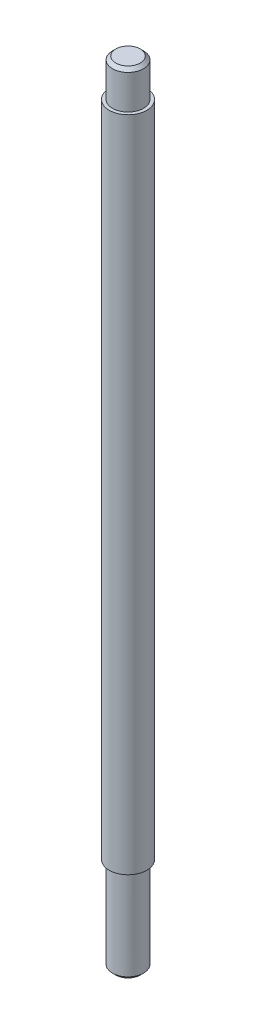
ISO-10303-21;
HEADER;
FILE_DESCRIPTION(('STEP AP214'),'2;1');
FILE_NAME('part.step','',(''),(''),'','','');
FILE_SCHEMA(('AUTOMOTIVE_DESIGN { 1 0 10303 214 1 1 1 1 }'));
ENDSEC;
DATA;
#1=APPLICATION_CONTEXT('core data for automotive mechanical design processes');
#2=APPLICATION_PROTOCOL_DEFINITION('international standard','automotive_design',2000,#1);
#3=PRODUCT_CONTEXT('',#1,'mechanical');
#4=PRODUCT('Part','Part','',(#3));
#5=PRODUCT_RELATED_PRODUCT_CATEGORY('part','',(#4));
#6=PRODUCT_DEFINITION_FORMATION('','',#4);
#7=PRODUCT_DEFINITION_CONTEXT('part definition',#1,'design');
#8=PRODUCT_DEFINITION('design','',#6,#7);
#9=PRODUCT_DEFINITION_SHAPE('','',#8);
#10=(LENGTH_UNIT() NAMED_UNIT(*) SI_UNIT(.MILLI.,.METRE.));
#11=(NAMED_UNIT(*) PLANE_ANGLE_UNIT() SI_UNIT($,.RADIAN.));
#12=(NAMED_UNIT(*) SI_UNIT($,.STERADIAN.) SOLID_ANGLE_UNIT());
#13=UNCERTAINTY_MEASURE_WITH_UNIT(LENGTH_MEASURE(1.E-05),#10,'distance_accuracy_value','');
#14=(GEOMETRIC_REPRESENTATION_CONTEXT(3) GLOBAL_UNCERTAINTY_ASSIGNED_CONTEXT((#13)) GLOBAL_UNIT_ASSIGNED_CONTEXT((#10,
#11,#12)) REPRESENTATION_CONTEXT('',''));
#15=CARTESIAN_POINT('',(0.,0.,0.));
#16=DIRECTION('',(0.,0.,1.));
#17=DIRECTION('',(1.,0.,0.));
#18=AXIS2_PLACEMENT_3D('',#15,#16,#17);
#19=CARTESIAN_POINT('',(0.,84.,0.));
#20=DIRECTION('',(0.,-1.,0.));
#21=DIRECTION('',(0.,0.,-1.));
#22=AXIS2_PLACEMENT_3D('',#19,#20,#21);
#23=CYLINDRICAL_SURFACE('',#22,2.);
#24=CARTESIAN_POINT('',(0.,80.,0.));
#25=DIRECTION('',(0.,1.,0.));
#26=DIRECTION('',(0.,0.,1.));
#27=AXIS2_PLACEMENT_3D('',#24,#25,#26);
#28=CIRCLE('',#27,2.);
#29=CARTESIAN_POINT('',(0.,80.,-2.));
#30=VERTEX_POINT('',#29);
#31=EDGE_CURVE('E51',#30,#30,#28,.T.);
#32=CARTESIAN_POINT('',(0.,9.99999999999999,0.));
#33=DIRECTION('',(0.,-1.,0.));
#34=DIRECTION('',(0.,0.,-1.));
#35=AXIS2_PLACEMENT_3D('',#32,#33,#34);
#36=CIRCLE('',#35,2.);
#37=CARTESIAN_POINT('',(0.,10.,-2.));
#38=VERTEX_POINT('',#37);
#39=EDGE_CURVE('E52',#38,#38,#36,.T.);
#40=CARTESIAN_POINT('',(0.,80.,-2.));
#41=CARTESIAN_POINT('',(0.,79.2708333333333,-2.));
#42=CARTESIAN_POINT('',(0.,78.5416666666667,-2.));
#43=CARTESIAN_POINT('',(0.,77.0833333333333,-2.));
#44=CARTESIAN_POINT('',(0.,76.3541666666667,-2.));
#45=CARTESIAN_POINT('',(0.,74.8958333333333,-2.));
#46=CARTESIAN_POINT('',(0.,74.1666666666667,-2.));
#47=CARTESIAN_POINT('',(0.,72.7083333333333,-2.));
#48=CARTESIAN_POINT('',(0.,71.9791666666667,-2.));
#49=CARTESIAN_POINT('',(0.,70.5208333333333,-2.));
#50=CARTESIAN_POINT('',(0.,69.7916666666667,-2.));
#51=CARTESIAN_POINT('',(0.,68.3333333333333,-2.));
#52=CARTESIAN_POINT('',(0.,67.6041666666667,-2.));
#53=CARTESIAN_POINT('',(0.,66.1458333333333,-2.));
#54=CARTESIAN_POINT('',(0.,65.4166666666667,-2.));
#55=CARTESIAN_POINT('',(0.,63.9583333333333,-2.));
#56=CARTESIAN_POINT('',(0.,63.2291666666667,-2.));
#57=CARTESIAN_POINT('',(0.,61.7708333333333,-2.));
#58=CARTESIAN_POINT('',(0.,61.0416666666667,-2.));
#59=CARTESIAN_POINT('',(0.,59.5833333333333,-2.));
#60=CARTESIAN_POINT('',(0.,58.8541666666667,-2.));
#61=CARTESIAN_POINT('',(0.,57.3958333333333,-2.));
#62=CARTESIAN_POINT('',(0.,56.6666666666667,-2.));
#63=CARTESIAN_POINT('',(0.,55.2083333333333,-2.));
#64=CARTESIAN_POINT('',(0.,54.4791666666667,-2.));
#65=CARTESIAN_POINT('',(0.,53.0208333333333,-2.));
#66=CARTESIAN_POINT('',(0.,52.2916666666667,-2.));
#67=CARTESIAN_POINT('',(0.,50.8333333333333,-2.));
#68=CARTESIAN_POINT('',(0.,50.1041666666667,-2.));
#69=CARTESIAN_POINT('',(0.,48.6458333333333,-2.));
#70=CARTESIAN_POINT('',(0.,47.9166666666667,-2.));
#71=CARTESIAN_POINT('',(0.,46.4583333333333,-2.));
#72=CARTESIAN_POINT('',(0.,45.7291666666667,-2.));
#73=CARTESIAN_POINT('',(0.,44.2708333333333,-2.));
#74=CARTESIAN_POINT('',(0.,43.5416666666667,-2.));
#75=CARTESIAN_POINT('',(0.,42.0833333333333,-2.));
#76=CARTESIAN_POINT('',(0.,41.3541666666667,-2.));
#77=CARTESIAN_POINT('',(0.,39.8958333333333,-2.));
#78=CARTESIAN_POINT('',(0.,39.1666666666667,-2.));
#79=CARTESIAN_POINT('',(0.,37.7083333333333,-2.));
#80=CARTESIAN_POINT('',(0.,36.9791666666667,-2.));
#81=CARTESIAN_POINT('',(0.,35.5208333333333,-2.));
#82=CARTESIAN_POINT('',(0.,34.7916666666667,-2.));
#83=CARTESIAN_POINT('',(0.,33.3333333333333,-2.));
#84=CARTESIAN_POINT('',(0.,32.6041666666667,-2.));
#85=CARTESIAN_POINT('',(0.,31.1458333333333,-2.));
#86=CARTESIAN_POINT('',(0.,30.4166666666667,-2.));
#87=CARTESIAN_POINT('',(0.,28.9583333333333,-2.));
#88=CARTESIAN_POINT('',(0.,28.2291666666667,-2.));
#89=CARTESIAN_POINT('',(0.,26.7708333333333,-2.));
#90=CARTESIAN_POINT('',(0.,26.0416666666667,-2.));
#91=CARTESIAN_POINT('',(0.,24.5833333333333,-2.));
#92=CARTESIAN_POINT('',(0.,23.8541666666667,-2.));
#93=CARTESIAN_POINT('',(0.,22.3958333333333,-2.));
#94=CARTESIAN_POINT('',(0.,21.6666666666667,-2.));
#95=CARTESIAN_POINT('',(0.,20.2083333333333,-2.));
#96=CARTESIAN_POINT('',(0.,19.4791666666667,-2.));
#97=CARTESIAN_POINT('',(0.,18.0208333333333,-2.));
#98=CARTESIAN_POINT('',(0.,17.2916666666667,-2.));
#99=CARTESIAN_POINT('',(0.,15.8333333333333,-2.));
#100=CARTESIAN_POINT('',(0.,15.1041666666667,-2.));
#101=CARTESIAN_POINT('',(0.,13.6458333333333,-2.));
#102=CARTESIAN_POINT('',(0.,12.9166666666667,-2.));
#103=CARTESIAN_POINT('',(0.,11.4583333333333,-2.));
#104=CARTESIAN_POINT('',(0.,10.7291666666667,-2.));
#105=CARTESIAN_POINT('',(0.,10.,-2.));
#106=B_SPLINE_CURVE_WITH_KNOTS('',3,(#40,#41,#42,#43,#44,#45,#46,#47,#48,#49,#50,#51,#52,#53,
#54,#55,#56,#57,#58,#59,#60,#61,#62,#63,#64,#65,#66,#67,#68,#69,#70,#71,#72,#73,#74,#75,#76,#77,
#78,#79,#80,#81,#82,#83,#84,#85,#86,#87,#88,#89,#90,#91,#92,#93,#94,#95,#96,#97,#98,#99,#100,
#101,#102,#103,#104,#105),.UNSPECIFIED.,.F.,.F.,(4,2,2,2,2,2,2,2,2,2,2,2,2,2,2,2,2,2,2,2,2,2,2,
2,2,2,2,2,2,2,2,2,4),(0.,2.18750000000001,4.375,6.56250000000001,8.75000000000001,10.9375,
13.125,15.3125,17.5,19.6875,21.875,24.0625,26.25,28.4375,30.625,32.8125,35.,37.1875,39.375,
41.5625,43.75,45.9375,48.125,50.3125,52.5,54.6875,56.875,59.0625,61.25,63.4375,65.625,67.8125,
70.),.UNSPECIFIED.);
#107=EDGE_CURVE('BSEAM31',#30,#38,#106,.T.);
#108=ORIENTED_EDGE('',*,*,#31,.F.);
#109=ORIENTED_EDGE('',*,*,#39,.F.);
#110=ORIENTED_EDGE('',*,*,#107,.T.);
#111=ORIENTED_EDGE('',*,*,#107,.F.);
#112=EDGE_LOOP('',(#108,#110,#109,#111));
#113=FACE_BOUND('',#112,.T.);
#114=ADVANCED_FACE('F31',(#113),#23,.T.);
#115=CARTESIAN_POINT('',(0.,80.,0.));
#116=DIRECTION('',(0.,1.,0.));
#117=DIRECTION('',(0.,0.,1.));
#118=AXIS2_PLACEMENT_3D('',#115,#116,#117);
#119=PLANE('',#118);
#120=CARTESIAN_POINT('',(0.,80.,0.));
#121=DIRECTION('',(0.,1.,0.));
#122=DIRECTION('',(0.,0.,1.));
#123=AXIS2_PLACEMENT_3D('',#120,#121,#122);
#124=CIRCLE('',#123,1.65);
#125=CARTESIAN_POINT('',(0.,80.,1.65));
#126=VERTEX_POINT('',#125);
#127=EDGE_CURVE('E55',#126,#126,#124,.T.);
#128=ORIENTED_EDGE('',*,*,#127,.F.);
#129=EDGE_LOOP('',(#128));
#130=FACE_BOUND('',#129,.T.);
#131=ORIENTED_EDGE('',*,*,#31,.T.);
#132=EDGE_LOOP('',(#131));
#133=FACE_BOUND('',#132,.T.);
#134=ADVANCED_FACE('F74',(#130,#133),#119,.T.);
#135=CARTESIAN_POINT('',(0.,80.,0.));
#136=DIRECTION('',(0.,1.,0.));
#137=DIRECTION('',(0.,0.,1.));
#138=AXIS2_PLACEMENT_3D('',#135,#136,#137);
#139=CYLINDRICAL_SURFACE('',#138,1.65);
#140=CARTESIAN_POINT('',(0.,83.65,0.));
#141=DIRECTION('',(0.,1.,0.));
#142=DIRECTION('',(0.,0.,1.));
#143=AXIS2_PLACEMENT_3D('',#140,#141,#142);
#144=CIRCLE('',#143,1.65);
#145=CARTESIAN_POINT('',(0.,83.65,1.65));
#146=VERTEX_POINT('',#145);
#147=EDGE_CURVE('E42',#146,#146,#144,.F.);
#148=ORIENTED_EDGE('',*,*,#147,.T.);
#149=EDGE_LOOP('',(#148));
#150=FACE_BOUND('',#149,.T.);
#151=ORIENTED_EDGE('',*,*,#127,.T.);
#152=EDGE_LOOP('',(#151));
#153=FACE_BOUND('',#152,.T.);
#154=ADVANCED_FACE('F80',(#150,#153),#139,.T.);
#155=CARTESIAN_POINT('',(0.,84.,0.));
#156=DIRECTION('',(0.,1.,0.));
#157=DIRECTION('',(0.,0.,1.));
#158=AXIS2_PLACEMENT_3D('',#155,#156,#157);
#159=PLANE('',#158);
#160=CARTESIAN_POINT('',(0.,84.,0.));
#161=DIRECTION('',(0.,1.,0.));
#162=DIRECTION('',(0.,0.,1.));
#163=AXIS2_PLACEMENT_3D('',#160,#161,#162);
#164=CIRCLE('',#163,1.3);
#165=CARTESIAN_POINT('',(0.,84.,1.3));
#166=VERTEX_POINT('',#165);
#167=EDGE_CURVE('E46',#166,#166,#164,.T.);
#168=ORIENTED_EDGE('',*,*,#167,.T.);
#169=EDGE_LOOP('',(#168));
#170=FACE_BOUND('',#169,.T.);
#171=ADVANCED_FACE('F69',(#170),#159,.T.);
#172=CARTESIAN_POINT('',(0.,10.,0.));
#173=DIRECTION('',(0.,-1.,0.));
#174=DIRECTION('',(0.,0.,-1.));
#175=AXIS2_PLACEMENT_3D('',#172,#173,#174);
#176=PLANE('',#175);
#177=CARTESIAN_POINT('',(0.,10.,0.));
#178=DIRECTION('',(0.,-1.,0.));
#179=DIRECTION('',(0.,0.,-1.));
#180=AXIS2_PLACEMENT_3D('',#177,#178,#179);
#181=CIRCLE('',#180,1.65);
#182=CARTESIAN_POINT('',(0.,10.,-1.65));
#183=VERTEX_POINT('',#182);
#184=EDGE_CURVE('E56',#183,#183,#181,.T.);
#185=ORIENTED_EDGE('',*,*,#184,.F.);
#186=EDGE_LOOP('',(#185));
#187=FACE_BOUND('',#186,.T.);
#188=ORIENTED_EDGE('',*,*,#39,.T.);
#189=EDGE_LOOP('',(#188));
#190=FACE_BOUND('',#189,.T.);
#191=ADVANCED_FACE('F66',(#187,#190),#176,.T.);
#192=CARTESIAN_POINT('',(0.,10.,0.));
#193=DIRECTION('',(0.,-1.,0.));
#194=DIRECTION('',(0.,0.,-1.));
#195=AXIS2_PLACEMENT_3D('',#192,#193,#194);
#196=CYLINDRICAL_SURFACE('',#195,1.65);
#197=CARTESIAN_POINT('',(0.,0.350000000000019,0.));
#198=DIRECTION('',(0.,1.,0.));
#199=DIRECTION('',(0.,0.,1.));
#200=AXIS2_PLACEMENT_3D('',#197,#198,#199);
#201=CIRCLE('',#200,1.65);
#202=CARTESIAN_POINT('',(0.,0.350000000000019,1.65));
#203=VERTEX_POINT('',#202);
#204=EDGE_CURVE('E10',#203,#203,#201,.T.);
#205=ORIENTED_EDGE('',*,*,#204,.T.);
#206=EDGE_LOOP('',(#205));
#207=FACE_BOUND('',#206,.T.);
#208=ORIENTED_EDGE('',*,*,#184,.T.);
#209=EDGE_LOOP('',(#208));
#210=FACE_BOUND('',#209,.T.);
#211=ADVANCED_FACE('F64',(#207,#210),#196,.T.);
#212=CARTESIAN_POINT('',(0.,0.,0.));
#213=DIRECTION('',(0.,1.,0.));
#214=DIRECTION('',(0.,0.,1.));
#215=AXIS2_PLACEMENT_3D('',#212,#213,#214);
#216=PLANE('',#215);
#217=CARTESIAN_POINT('',(0.,0.,0.));
#218=DIRECTION('',(0.,1.,0.));
#219=DIRECTION('',(0.,0.,1.));
#220=AXIS2_PLACEMENT_3D('',#217,#218,#219);
#221=CIRCLE('',#220,1.29999999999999);
#222=CARTESIAN_POINT('',(0.,0.,1.29999999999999));
#223=VERTEX_POINT('',#222);
#224=EDGE_CURVE('E38',#223,#223,#221,.F.);
#225=ORIENTED_EDGE('',*,*,#224,.T.);
#226=EDGE_LOOP('',(#225));
#227=FACE_BOUND('',#226,.T.);
#228=ADVANCED_FACE('F85',(#227),#216,.F.);
#229=CARTESIAN_POINT('',(0.,84.,0.));
#230=DIRECTION('',(0.,-1.,0.));
#231=DIRECTION('',(0.,0.,-1.));
#232=AXIS2_PLACEMENT_3D('',#229,#230,#231);
#233=CONICAL_SURFACE('',#232,1.3,0.785398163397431);
#234=ORIENTED_EDGE('',*,*,#147,.F.);
#235=EDGE_LOOP('',(#234));
#236=FACE_BOUND('',#235,.T.);
#237=ORIENTED_EDGE('',*,*,#167,.F.);
#238=EDGE_LOOP('',(#237));
#239=FACE_BOUND('',#238,.T.);
#240=ADVANCED_FACE('F87',(#236,#239),#233,.T.);
#241=CARTESIAN_POINT('',(0.,0.,0.));
#242=DIRECTION('',(0.,1.,0.));
#243=DIRECTION('',(0.,0.,1.));
#244=AXIS2_PLACEMENT_3D('',#241,#242,#243);
#245=CONICAL_SURFACE('',#244,1.29999999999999,0.785398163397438);
#246=ORIENTED_EDGE('',*,*,#204,.F.);
#247=EDGE_LOOP('',(#246));
#248=FACE_BOUND('',#247,.T.);
#249=ORIENTED_EDGE('',*,*,#224,.F.);
#250=EDGE_LOOP('',(#249));
#251=FACE_BOUND('',#250,.T.);
#252=ADVANCED_FACE('F33',(#248,#251),#245,.T.);
#253=CLOSED_SHELL('',(#114,#134,#154,#171,#191,#211,#228,#240,#252));
#254=MANIFOLD_SOLID_BREP('B2',#253);
#255=ADVANCED_BREP_SHAPE_REPRESENTATION('',(#18,#254),#14);
#256=SHAPE_DEFINITION_REPRESENTATION(#9,#255);
ENDSEC;
END-ISO-10303-21;
